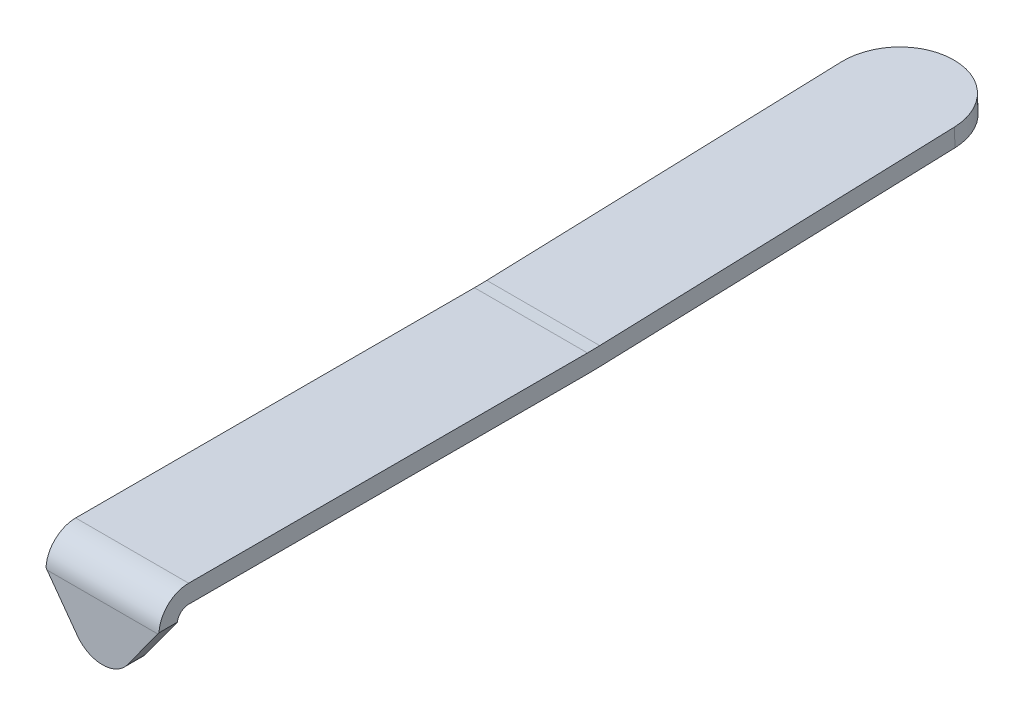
ISO-10303-21;
HEADER;
FILE_DESCRIPTION(('STEP AP214'),'2;1');
FILE_NAME('part.step','',(''),(''),'','','');
FILE_SCHEMA(('AUTOMOTIVE_DESIGN { 1 0 10303 214 1 1 1 1 }'));
ENDSEC;
DATA;
#1=APPLICATION_CONTEXT('core data for automotive mechanical design processes');
#2=APPLICATION_PROTOCOL_DEFINITION('international standard','automotive_design',2000,#1);
#3=PRODUCT_CONTEXT('',#1,'mechanical');
#4=PRODUCT('Part','Part','',(#3));
#5=PRODUCT_RELATED_PRODUCT_CATEGORY('part','',(#4));
#6=PRODUCT_DEFINITION_FORMATION('','',#4);
#7=PRODUCT_DEFINITION_CONTEXT('part definition',#1,'design');
#8=PRODUCT_DEFINITION('design','',#6,#7);
#9=PRODUCT_DEFINITION_SHAPE('','',#8);
#10=(LENGTH_UNIT() NAMED_UNIT(*) SI_UNIT(.MILLI.,.METRE.));
#11=(NAMED_UNIT(*) PLANE_ANGLE_UNIT() SI_UNIT($,.RADIAN.));
#12=(NAMED_UNIT(*) SI_UNIT($,.STERADIAN.) SOLID_ANGLE_UNIT());
#13=UNCERTAINTY_MEASURE_WITH_UNIT(LENGTH_MEASURE(1.E-05),#10,'distance_accuracy_value','');
#14=(GEOMETRIC_REPRESENTATION_CONTEXT(3) GLOBAL_UNCERTAINTY_ASSIGNED_CONTEXT((#13)) GLOBAL_UNIT_ASSIGNED_CONTEXT((#10,
#11,#12)) REPRESENTATION_CONTEXT('',''));
#15=CARTESIAN_POINT('',(0.,0.,0.));
#16=DIRECTION('',(0.,0.,1.));
#17=DIRECTION('',(1.,0.,0.));
#18=AXIS2_PLACEMENT_3D('',#15,#16,#17);
#19=CARTESIAN_POINT('',(-3.9243,1.27,0.));
#20=DIRECTION('',(0.,0.,-1.));
#21=DIRECTION('',(0.,1.,0.));
#22=AXIS2_PLACEMENT_3D('',#19,#20,#21);
#23=PLANE('',#22);
#24=DIRECTION('',(0.587785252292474,0.809016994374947,0.));
#25=VECTOR('',#24,1.);
#26=CARTESIAN_POINT('',(3.9243,-0.68477461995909,0.));
#27=LINE('',#26,#25);
#28=CARTESIAN_POINT('',(1.74666769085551,-3.68202835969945,0.));
#29=VERTEX_POINT('',#28);
#30=CARTESIAN_POINT('',(3.84512475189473,-0.793749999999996,0.));
#31=VERTEX_POINT('',#30);
#32=EDGE_CURVE('E160',#29,#31,#27,.T.);
#33=ORIENTED_EDGE('',*,*,#32,.T.);
#34=DIRECTION('',(1.,0.,0.));
#35=VECTOR('',#34,1.);
#36=CARTESIAN_POINT('',(-3.9243,-0.793749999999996,0.));
#37=LINE('',#36,#35);
#38=CARTESIAN_POINT('',(-3.84512475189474,-0.793749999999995,0.));
#39=VERTEX_POINT('',#38);
#40=EDGE_CURVE('E257',#31,#39,#37,.F.);
#41=ORIENTED_EDGE('',*,*,#40,.T.);
#42=DIRECTION('',(0.587785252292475,-0.809016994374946,0.));
#43=VECTOR('',#42,1.);
#44=CARTESIAN_POINT('',(-1.74666769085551,-3.68202835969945,0.));
#45=LINE('',#44,#43);
#46=CARTESIAN_POINT('',(-1.74666769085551,-3.68202835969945,0.));
#47=VERTEX_POINT('',#46);
#48=EDGE_CURVE('E180',#39,#47,#45,.T.);
#49=ORIENTED_EDGE('',*,*,#48,.T.);
#50=CARTESIAN_POINT('',(0.,-2.413,0.));
#51=DIRECTION('',(0.,0.,1.));
#52=DIRECTION('',(-1.,0.,0.));
#53=AXIS2_PLACEMENT_3D('',#50,#51,#52);
#54=CIRCLE('',#53,2.159);
#55=EDGE_CURVE('E185',#47,#29,#54,.T.);
#56=ORIENTED_EDGE('',*,*,#55,.T.);
#57=EDGE_LOOP('',(#33,#41,#49,#56));
#58=FACE_BOUND('',#57,.T.);
#59=ADVANCED_FACE('F35',(#58),#23,.F.);
#60=CARTESIAN_POINT('',(-3.9243,1.27,-29.765625));
#61=DIRECTION('',(0.,-1.,0.));
#62=DIRECTION('',(0.,0.,-1.));
#63=AXIS2_PLACEMENT_3D('',#60,#61,#62);
#64=PLANE('',#63);
#65=DIRECTION('',(0.,0.,-1.));
#66=VECTOR('',#65,1.);
#67=CARTESIAN_POINT('',(-3.9243,1.27,-29.765625));
#68=LINE('',#67,#66);
#69=CARTESIAN_POINT('',(-3.9243,1.27,-2.06375));
#70=VERTEX_POINT('',#69);
#71=CARTESIAN_POINT('',(-3.9243,1.27,-29.765625));
#72=VERTEX_POINT('',#71);
#73=EDGE_CURVE('E194',#70,#72,#68,.T.);
#74=ORIENTED_EDGE('',*,*,#73,.F.);
#75=DIRECTION('',(1.,0.,0.));
#76=VECTOR('',#75,1.);
#77=CARTESIAN_POINT('',(-3.9243,1.27,-2.06375));
#78=LINE('',#77,#76);
#79=CARTESIAN_POINT('',(3.9243,1.27,-2.06375));
#80=VERTEX_POINT('',#79);
#81=EDGE_CURVE('E250',#70,#80,#78,.T.);
#82=ORIENTED_EDGE('',*,*,#81,.T.);
#83=DIRECTION('',(0.,0.,-1.));
#84=VECTOR('',#83,1.);
#85=CARTESIAN_POINT('',(3.9243,1.27,-29.765625));
#86=LINE('',#85,#84);
#87=CARTESIAN_POINT('',(3.9243,1.27,-29.765625));
#88=VERTEX_POINT('',#87);
#89=EDGE_CURVE('E189',#80,#88,#86,.T.);
#90=ORIENTED_EDGE('',*,*,#89,.T.);
#91=DIRECTION('',(1.,0.,0.));
#92=VECTOR('',#91,1.);
#93=CARTESIAN_POINT('',(-3.9243,1.27,-29.765625));
#94=LINE('',#93,#92);
#95=EDGE_CURVE('E234',#72,#88,#94,.T.);
#96=ORIENTED_EDGE('',*,*,#95,.F.);
#97=EDGE_LOOP('',(#74,#82,#90,#96));
#98=FACE_BOUND('',#97,.T.);
#99=ADVANCED_FACE('F308',(#98),#64,.F.);
#100=CARTESIAN_POINT('',(-3.9243,26.67,-29.765625));
#101=DIRECTION('',(1.,0.,0.));
#102=DIRECTION('',(0.,0.,-1.));
#103=AXIS2_PLACEMENT_3D('',#100,#101,#102);
#104=CYLINDRICAL_SURFACE('',#103,25.4);
#105=CARTESIAN_POINT('',(3.9243,26.67,-29.765625));
#106=DIRECTION('',(1.,0.,0.));
#107=DIRECTION('',(0.,0.,1.));
#108=AXIS2_PLACEMENT_3D('',#105,#106,#107);
#109=CIRCLE('',#108,25.4);
#110=CARTESIAN_POINT('',(3.9243,1.2843645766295,-30.6197410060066));
#111=VERTEX_POINT('',#110);
#112=EDGE_CURVE('E210',#88,#111,#109,.T.);
#113=ORIENTED_EDGE('',*,*,#112,.T.);
#114=DIRECTION('',(1.,0.,0.));
#115=VECTOR('',#114,1.);
#116=CARTESIAN_POINT('',(-3.9243,1.2843645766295,-30.6197410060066));
#117=LINE('',#116,#115);
#118=CARTESIAN_POINT('',(-3.9243,1.2843645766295,-30.6197410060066));
#119=VERTEX_POINT('',#118);
#120=EDGE_CURVE('E231',#119,#111,#117,.T.);
#121=ORIENTED_EDGE('',*,*,#120,.F.);
#122=CARTESIAN_POINT('',(-3.9243,26.67,-29.765625));
#123=DIRECTION('',(1.,0.,0.));
#124=DIRECTION('',(0.,0.,1.));
#125=AXIS2_PLACEMENT_3D('',#122,#123,#124);
#126=CIRCLE('',#125,25.4);
#127=EDGE_CURVE('E196',#72,#119,#126,.T.);
#128=ORIENTED_EDGE('',*,*,#127,.F.);
#129=ORIENTED_EDGE('',*,*,#95,.T.);
#130=EDGE_LOOP('',(#113,#121,#128,#129));
#131=FACE_BOUND('',#130,.T.);
#132=ADVANCED_FACE('F314',(#131),#104,.F.);
#133=CARTESIAN_POINT('',(-3.9243,2.24392325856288,-59.1392941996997));
#134=DIRECTION('',(0.,-0.999434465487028,-0.0336266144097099));
#135=DIRECTION('',(0.,0.0336266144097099,-0.999434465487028));
#136=AXIS2_PLACEMENT_3D('',#133,#134,#135);
#137=PLANE('',#136);
#138=DIRECTION('',(0.,0.0336266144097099,-0.999434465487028));
#139=VECTOR('',#138,1.);
#140=CARTESIAN_POINT('',(3.9243,2.24392325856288,-59.1392941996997));
#141=LINE('',#140,#139);
#142=CARTESIAN_POINT('',(3.9243,2.11324350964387,-55.255291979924));
#143=VERTEX_POINT('',#142);
#144=EDGE_CURVE('E212',#111,#143,#141,.T.);
#145=ORIENTED_EDGE('',*,*,#144,.T.);
#146=CARTESIAN_POINT('',(0.0381000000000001,2.11324350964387,-55.255291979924));
#147=DIRECTION('',(0.,-0.999434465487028,-0.0336266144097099));
#148=DIRECTION('',(0.,0.0336266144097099,-0.999434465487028));
#149=AXIS2_PLACEMENT_3D('',#146,#147,#148);
#150=CIRCLE('',#149,3.8862);
#151=CARTESIAN_POINT('',(0.0381000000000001,2.24392325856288,-59.1392941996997));
#152=VERTEX_POINT('',#151);
#153=EDGE_CURVE('E43',#143,#152,#150,.F.);
#154=ORIENTED_EDGE('',*,*,#153,.T.);
#155=DIRECTION('',(1.,0.,0.));
#156=VECTOR('',#155,1.);
#157=CARTESIAN_POINT('',(-3.9243,2.24392325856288,-59.1392941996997));
#158=LINE('',#157,#156);
#159=CARTESIAN_POINT('',(-0.0380999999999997,2.24392325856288,-59.1392941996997));
#160=VERTEX_POINT('',#159);
#161=EDGE_CURVE('E228',#160,#152,#158,.T.);
#162=ORIENTED_EDGE('',*,*,#161,.F.);
#163=CARTESIAN_POINT('',(-0.0380999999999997,2.11324350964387,-55.255291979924));
#164=DIRECTION('',(0.,-0.999434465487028,-0.0336266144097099));
#165=DIRECTION('',(0.,0.0336266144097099,-0.999434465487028));
#166=AXIS2_PLACEMENT_3D('',#163,#164,#165);
#167=CIRCLE('',#166,3.8862);
#168=CARTESIAN_POINT('',(-3.9243,2.11324350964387,-55.255291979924));
#169=VERTEX_POINT('',#168);
#170=EDGE_CURVE('E50',#160,#169,#167,.F.);
#171=ORIENTED_EDGE('',*,*,#170,.T.);
#172=DIRECTION('',(0.,0.0336266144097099,-0.999434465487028));
#173=VECTOR('',#172,1.);
#174=CARTESIAN_POINT('',(-3.9243,2.24392325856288,-59.1392941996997));
#175=LINE('',#174,#173);
#176=EDGE_CURVE('E199',#119,#169,#175,.T.);
#177=ORIENTED_EDGE('',*,*,#176,.F.);
#178=ORIENTED_EDGE('',*,*,#120,.T.);
#179=EDGE_LOOP('',(#145,#154,#162,#171,#177,#178));
#180=FACE_BOUND('',#179,.T.);
#181=ADVANCED_FACE('F274',(#180),#137,.F.);
#182=CARTESIAN_POINT('',(-3.9243,0.974641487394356,-59.182));
#183=DIRECTION('',(0.,-0.0336266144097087,0.999434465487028));
#184=DIRECTION('',(0.,-0.999434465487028,-0.0336266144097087));
#185=AXIS2_PLACEMENT_3D('',#182,#183,#184);
#186=PLANE('',#185);
#187=ORIENTED_EDGE('',*,*,#161,.T.);
#188=DIRECTION('',(0.,-0.999434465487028,-0.0336266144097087));
#189=VECTOR('',#188,1.);
#190=CARTESIAN_POINT('',(0.0381000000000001,0.974641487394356,-59.182));
#191=LINE('',#190,#189);
#192=CARTESIAN_POINT('',(0.0381000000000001,0.974641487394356,-59.182));
#193=VERTEX_POINT('',#192);
#194=EDGE_CURVE('E265',#152,#193,#191,.T.);
#195=ORIENTED_EDGE('',*,*,#194,.T.);
#196=DIRECTION('',(1.,0.,0.));
#197=VECTOR('',#196,1.);
#198=CARTESIAN_POINT('',(-3.9243,0.974641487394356,-59.182));
#199=LINE('',#198,#197);
#200=CARTESIAN_POINT('',(-0.0380999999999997,0.974641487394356,-59.182));
#201=VERTEX_POINT('',#200);
#202=EDGE_CURVE('E225',#201,#193,#199,.T.);
#203=ORIENTED_EDGE('',*,*,#202,.F.);
#204=DIRECTION('',(0.,-0.999434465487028,-0.0336266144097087));
#205=VECTOR('',#204,1.);
#206=CARTESIAN_POINT('',(-0.0380999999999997,0.974641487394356,-59.182));
#207=LINE('',#206,#205);
#208=EDGE_CURVE('E263',#201,#160,#207,.F.);
#209=ORIENTED_EDGE('',*,*,#208,.T.);
#210=EDGE_LOOP('',(#187,#195,#203,#209));
#211=FACE_BOUND('',#210,.T.);
#212=ADVANCED_FACE('F278',(#211),#186,.F.);
#213=CARTESIAN_POINT('',(-3.9243,0.0150828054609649,-30.662446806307));
#214=DIRECTION('',(0.,0.999434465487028,0.0336266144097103));
#215=DIRECTION('',(0.,-0.0336266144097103,0.999434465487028));
#216=AXIS2_PLACEMENT_3D('',#213,#214,#215);
#217=PLANE('',#216);
#218=ORIENTED_EDGE('',*,*,#202,.T.);
#219=CARTESIAN_POINT('',(0.0381000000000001,0.84396173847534,-55.2979977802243));
#220=DIRECTION('',(0.,0.999434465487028,0.0336266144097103));
#221=DIRECTION('',(0.,-0.0336266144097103,0.999434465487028));
#222=AXIS2_PLACEMENT_3D('',#219,#220,#221);
#223=CIRCLE('',#222,3.8862);
#224=CARTESIAN_POINT('',(3.9243,0.84396173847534,-55.2979977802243));
#225=VERTEX_POINT('',#224);
#226=EDGE_CURVE('E270',#193,#225,#223,.F.);
#227=ORIENTED_EDGE('',*,*,#226,.T.);
#228=DIRECTION('',(0.,-0.0336266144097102,0.999434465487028));
#229=VECTOR('',#228,1.);
#230=CARTESIAN_POINT('',(3.9243,0.0150828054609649,-30.662446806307));
#231=LINE('',#230,#229);
#232=CARTESIAN_POINT('',(3.9243,0.0150828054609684,-30.662446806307));
#233=VERTEX_POINT('',#232);
#234=EDGE_CURVE('E214',#225,#233,#231,.T.);
#235=ORIENTED_EDGE('',*,*,#234,.T.);
#236=DIRECTION('',(1.,0.,0.));
#237=VECTOR('',#236,1.);
#238=CARTESIAN_POINT('',(-3.9243,0.0150828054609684,-30.662446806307));
#239=LINE('',#238,#237);
#240=CARTESIAN_POINT('',(-3.9243,0.0150828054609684,-30.662446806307));
#241=VERTEX_POINT('',#240);
#242=EDGE_CURVE('E222',#241,#233,#239,.T.);
#243=ORIENTED_EDGE('',*,*,#242,.F.);
#244=DIRECTION('',(0.,-0.0336266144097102,0.999434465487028));
#245=VECTOR('',#244,1.);
#246=CARTESIAN_POINT('',(-3.9243,0.0150828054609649,-30.662446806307));
#247=LINE('',#246,#245);
#248=CARTESIAN_POINT('',(-3.9243,0.84396173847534,-55.2979977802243));
#249=VERTEX_POINT('',#248);
#250=EDGE_CURVE('E201',#249,#241,#247,.T.);
#251=ORIENTED_EDGE('',*,*,#250,.F.);
#252=CARTESIAN_POINT('',(-0.0380999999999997,0.843961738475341,-55.2979977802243));
#253=DIRECTION('',(0.,0.999434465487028,0.0336266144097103));
#254=DIRECTION('',(0.,-0.0336266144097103,0.999434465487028));
#255=AXIS2_PLACEMENT_3D('',#252,#253,#254);
#256=CIRCLE('',#255,3.8862);
#257=EDGE_CURVE('E268',#249,#201,#256,.F.);
#258=ORIENTED_EDGE('',*,*,#257,.T.);
#259=EDGE_LOOP('',(#218,#227,#235,#243,#251,#258));
#260=FACE_BOUND('',#259,.T.);
#261=ADVANCED_FACE('F283',(#260),#217,.F.);
#262=CARTESIAN_POINT('',(-3.9243,26.67,-29.7656250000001));
#263=DIRECTION('',(1.,0.,0.));
#264=DIRECTION('',(0.,0.,-1.));
#265=AXIS2_PLACEMENT_3D('',#262,#263,#264);
#266=CYLINDRICAL_SURFACE('',#265,26.67);
#267=CARTESIAN_POINT('',(3.9243,26.67,-29.7656250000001));
#268=DIRECTION('',(-1.,0.,0.));
#269=DIRECTION('',(0.,0.,-1.));
#270=AXIS2_PLACEMENT_3D('',#267,#268,#269);
#271=CIRCLE('',#270,26.67);
#272=CARTESIAN_POINT('',(3.9243,0.,-29.765625));
#273=VERTEX_POINT('',#272);
#274=EDGE_CURVE('E216',#233,#273,#271,.T.);
#275=ORIENTED_EDGE('',*,*,#274,.T.);
#276=DIRECTION('',(1.,0.,0.));
#277=VECTOR('',#276,1.);
#278=CARTESIAN_POINT('',(-3.9243,0.,-29.765625));
#279=LINE('',#278,#277);
#280=CARTESIAN_POINT('',(-3.9243,0.,-29.765625));
#281=VERTEX_POINT('',#280);
#282=EDGE_CURVE('E208',#281,#273,#279,.T.);
#283=ORIENTED_EDGE('',*,*,#282,.F.);
#284=CARTESIAN_POINT('',(-3.9243,26.67,-29.7656250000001));
#285=DIRECTION('',(-1.,0.,0.));
#286=DIRECTION('',(0.,0.,-1.));
#287=AXIS2_PLACEMENT_3D('',#284,#285,#286);
#288=CIRCLE('',#287,26.67);
#289=EDGE_CURVE('E203',#241,#281,#288,.T.);
#290=ORIENTED_EDGE('',*,*,#289,.F.);
#291=ORIENTED_EDGE('',*,*,#242,.T.);
#292=EDGE_LOOP('',(#275,#283,#290,#291));
#293=FACE_BOUND('',#292,.T.);
#294=ADVANCED_FACE('F290',(#293),#266,.T.);
#295=CARTESIAN_POINT('',(-3.9243,0.,0.));
#296=DIRECTION('',(0.,1.,0.));
#297=DIRECTION('',(0.,0.,1.));
#298=AXIS2_PLACEMENT_3D('',#295,#296,#297);
#299=PLANE('',#298);
#300=DIRECTION('',(0.,0.,1.));
#301=VECTOR('',#300,1.);
#302=CARTESIAN_POINT('',(3.9243,0.,0.));
#303=LINE('',#302,#301);
#304=CARTESIAN_POINT('',(3.9243,0.,-2.06375));
#305=VERTEX_POINT('',#304);
#306=EDGE_CURVE('E197',#273,#305,#303,.T.);
#307=ORIENTED_EDGE('',*,*,#306,.T.);
#308=DIRECTION('',(-1.,0.,0.));
#309=VECTOR('',#308,1.);
#310=CARTESIAN_POINT('',(-3.9243,0.,-2.06375));
#311=LINE('',#310,#309);
#312=CARTESIAN_POINT('',(-3.9243,0.,-2.06375));
#313=VERTEX_POINT('',#312);
#314=EDGE_CURVE('E237',#305,#313,#311,.T.);
#315=ORIENTED_EDGE('',*,*,#314,.T.);
#316=DIRECTION('',(0.,0.,1.));
#317=VECTOR('',#316,1.);
#318=CARTESIAN_POINT('',(-3.9243,0.,0.));
#319=LINE('',#318,#317);
#320=EDGE_CURVE('E205',#281,#313,#319,.T.);
#321=ORIENTED_EDGE('',*,*,#320,.F.);
#322=ORIENTED_EDGE('',*,*,#282,.T.);
#323=EDGE_LOOP('',(#307,#315,#321,#322));
#324=FACE_BOUND('',#323,.T.);
#325=ADVANCED_FACE('F294',(#324),#299,.F.);
#326=CARTESIAN_POINT('',(-3.9243,26.67,-29.7656250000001));
#327=DIRECTION('',(1.,0.,0.));
#328=DIRECTION('',(0.,0.,-1.));
#329=AXIS2_PLACEMENT_3D('',#326,#327,#328);
#330=PLANE('',#329);
#331=ORIENTED_EDGE('',*,*,#176,.T.);
#332=DIRECTION('',(0.,-0.999434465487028,-0.0336266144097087));
#333=VECTOR('',#332,1.);
#334=CARTESIAN_POINT('',(-3.9243,27.4988789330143,-54.4011759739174));
#335=LINE('',#334,#333);
#336=EDGE_CURVE('E11',#169,#249,#335,.T.);
#337=ORIENTED_EDGE('',*,*,#336,.T.);
#338=ORIENTED_EDGE('',*,*,#250,.T.);
#339=ORIENTED_EDGE('',*,*,#289,.T.);
#340=ORIENTED_EDGE('',*,*,#320,.T.);
#341=CARTESIAN_POINT('',(-3.9243,-0.79375,-2.06375));
#342=DIRECTION('',(1.,0.,0.));
#343=DIRECTION('',(0.,0.,-1.));
#344=AXIS2_PLACEMENT_3D('',#341,#342,#343);
#345=CIRCLE('',#344,0.79375);
#346=CARTESIAN_POINT('',(-3.9243,-0.684774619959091,-1.27751630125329));
#347=VERTEX_POINT('',#346);
#348=EDGE_CURVE('E241',#313,#347,#345,.T.);
#349=ORIENTED_EDGE('',*,*,#348,.T.);
#350=DIRECTION('',(0.,0.,1.));
#351=VECTOR('',#350,1.);
#352=CARTESIAN_POINT('',(-3.9243,-0.684774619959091,-1.27));
#353=LINE('',#352,#351);
#354=CARTESIAN_POINT('',(-3.9243,-0.684774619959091,-0.00287920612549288));
#355=VERTEX_POINT('',#354);
#356=EDGE_CURVE('E190',#347,#355,#353,.T.);
#357=ORIENTED_EDGE('',*,*,#356,.T.);
#358=CARTESIAN_POINT('',(-3.9243,-0.793749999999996,-2.06375));
#359=DIRECTION('',(1.,0.,0.));
#360=DIRECTION('',(0.,0.,-1.));
#361=AXIS2_PLACEMENT_3D('',#358,#359,#360);
#362=CIRCLE('',#361,2.06375);
#363=EDGE_CURVE('E261',#355,#70,#362,.F.);
#364=ORIENTED_EDGE('',*,*,#363,.T.);
#365=ORIENTED_EDGE('',*,*,#73,.T.);
#366=ORIENTED_EDGE('',*,*,#127,.T.);
#367=EDGE_LOOP('',(#331,#337,#338,#339,#340,#349,#357,#364,#365,#366));
#368=FACE_BOUND('',#367,.T.);
#369=ADVANCED_FACE('F297',(#368),#330,.F.);
#370=CARTESIAN_POINT('',(3.9243,26.67,-29.7656250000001));
#371=DIRECTION('',(1.,0.,0.));
#372=DIRECTION('',(0.,0.,-1.));
#373=AXIS2_PLACEMENT_3D('',#370,#371,#372);
#374=PLANE('',#373);
#375=ORIENTED_EDGE('',*,*,#234,.F.);
#376=DIRECTION('',(0.,-0.999434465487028,-0.0336266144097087));
#377=VECTOR('',#376,1.);
#378=CARTESIAN_POINT('',(3.9243,2.11324350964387,-55.255291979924));
#379=LINE('',#378,#377);
#380=EDGE_CURVE('E58',#225,#143,#379,.F.);
#381=ORIENTED_EDGE('',*,*,#380,.T.);
#382=ORIENTED_EDGE('',*,*,#144,.F.);
#383=ORIENTED_EDGE('',*,*,#112,.F.);
#384=ORIENTED_EDGE('',*,*,#89,.F.);
#385=CARTESIAN_POINT('',(3.9243,-0.793749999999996,-2.06375));
#386=DIRECTION('',(1.,0.,0.));
#387=DIRECTION('',(0.,0.,-1.));
#388=AXIS2_PLACEMENT_3D('',#385,#386,#387);
#389=CIRCLE('',#388,2.06375);
#390=CARTESIAN_POINT('',(3.9243,-0.68477461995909,-0.00287920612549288));
#391=VERTEX_POINT('',#390);
#392=EDGE_CURVE('E253',#80,#391,#389,.T.);
#393=ORIENTED_EDGE('',*,*,#392,.T.);
#394=DIRECTION('',(0.,0.,1.));
#395=VECTOR('',#394,1.);
#396=CARTESIAN_POINT('',(3.9243,-0.68477461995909,-1.27));
#397=LINE('',#396,#395);
#398=CARTESIAN_POINT('',(3.9243,-0.68477461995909,-1.27751630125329));
#399=VERTEX_POINT('',#398);
#400=EDGE_CURVE('E165',#399,#391,#397,.T.);
#401=ORIENTED_EDGE('',*,*,#400,.F.);
#402=CARTESIAN_POINT('',(3.9243,-0.79375,-2.06375));
#403=DIRECTION('',(1.,0.,0.));
#404=DIRECTION('',(0.,0.,-1.));
#405=AXIS2_PLACEMENT_3D('',#402,#403,#404);
#406=CIRCLE('',#405,0.79375);
#407=EDGE_CURVE('E248',#399,#305,#406,.F.);
#408=ORIENTED_EDGE('',*,*,#407,.T.);
#409=ORIENTED_EDGE('',*,*,#306,.F.);
#410=ORIENTED_EDGE('',*,*,#274,.F.);
#411=EDGE_LOOP('',(#375,#381,#382,#383,#384,#393,#401,#408,#409,#410));
#412=FACE_BOUND('',#411,.T.);
#413=ADVANCED_FACE('F286',(#412),#374,.T.);
#414=CARTESIAN_POINT('',(0.,-2.413,-1.27));
#415=DIRECTION('',(0.,0.,-1.));
#416=DIRECTION('',(-1.,0.,0.));
#417=AXIS2_PLACEMENT_3D('',#414,#415,#416);
#418=PLANE('',#417);
#419=DIRECTION('',(0.587785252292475,-0.809016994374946,0.));
#420=VECTOR('',#419,1.);
#421=CARTESIAN_POINT('',(-1.74666769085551,-3.68202835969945,-1.27));
#422=LINE('',#421,#420);
#423=CARTESIAN_POINT('',(-3.84512475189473,-0.79375,-1.27));
#424=VERTEX_POINT('',#423);
#425=CARTESIAN_POINT('',(-1.74666769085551,-3.68202835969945,-1.27));
#426=VERTEX_POINT('',#425);
#427=EDGE_CURVE('E166',#424,#426,#422,.T.);
#428=ORIENTED_EDGE('',*,*,#427,.F.);
#429=DIRECTION('',(-1.,0.,0.));
#430=VECTOR('',#429,1.);
#431=CARTESIAN_POINT('',(0.,-0.79375,-1.27));
#432=LINE('',#431,#430);
#433=CARTESIAN_POINT('',(3.84512475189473,-0.79375,-1.27));
#434=VERTEX_POINT('',#433);
#435=EDGE_CURVE('E174',#424,#434,#432,.F.);
#436=ORIENTED_EDGE('',*,*,#435,.T.);
#437=DIRECTION('',(0.587785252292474,0.809016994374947,0.));
#438=VECTOR('',#437,1.);
#439=CARTESIAN_POINT('',(3.9243,-0.68477461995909,-1.27));
#440=LINE('',#439,#438);
#441=CARTESIAN_POINT('',(1.74666769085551,-3.68202835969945,-1.27));
#442=VERTEX_POINT('',#441);
#443=EDGE_CURVE('E157',#442,#434,#440,.T.);
#444=ORIENTED_EDGE('',*,*,#443,.F.);
#445=CARTESIAN_POINT('',(0.,-2.413,-1.27));
#446=DIRECTION('',(0.,0.,1.));
#447=DIRECTION('',(-1.,0.,0.));
#448=AXIS2_PLACEMENT_3D('',#445,#446,#447);
#449=CIRCLE('',#448,2.159);
#450=EDGE_CURVE('E172',#426,#442,#449,.T.);
#451=ORIENTED_EDGE('',*,*,#450,.F.);
#452=EDGE_LOOP('',(#428,#436,#444,#451));
#453=FACE_BOUND('',#452,.T.);
#454=ADVANCED_FACE('F171',(#453),#418,.T.);
#455=CARTESIAN_POINT('',(0.,-2.413,-1.27));
#456=DIRECTION('',(0.,0.,1.));
#457=DIRECTION('',(1.,0.,0.));
#458=AXIS2_PLACEMENT_3D('',#455,#456,#457);
#459=CYLINDRICAL_SURFACE('',#458,2.159);
#460=ORIENTED_EDGE('',*,*,#55,.F.);
#461=DIRECTION('',(0.,0.,1.));
#462=VECTOR('',#461,1.);
#463=CARTESIAN_POINT('',(-1.74666769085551,-3.68202835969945,-1.27));
#464=LINE('',#463,#462);
#465=EDGE_CURVE('E179',#426,#47,#464,.T.);
#466=ORIENTED_EDGE('',*,*,#465,.F.);
#467=ORIENTED_EDGE('',*,*,#450,.T.);
#468=DIRECTION('',(0.,0.,1.));
#469=VECTOR('',#468,1.);
#470=CARTESIAN_POINT('',(1.74666769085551,-3.68202835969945,-1.27));
#471=LINE('',#470,#469);
#472=EDGE_CURVE('E152',#442,#29,#471,.T.);
#473=ORIENTED_EDGE('',*,*,#472,.T.);
#474=EDGE_LOOP('',(#460,#466,#467,#473));
#475=FACE_BOUND('',#474,.T.);
#476=ADVANCED_FACE('F177',(#475),#459,.T.);
#477=CARTESIAN_POINT('',(-1.74666769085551,-3.68202835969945,-1.27));
#478=DIRECTION('',(-0.809016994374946,-0.587785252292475,0.));
#479=DIRECTION('',(0.587785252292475,-0.809016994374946,0.));
#480=AXIS2_PLACEMENT_3D('',#477,#478,#479);
#481=PLANE('',#480);
#482=ORIENTED_EDGE('',*,*,#48,.F.);
#483=CARTESIAN_POINT('',(-3.84512475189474,-0.793749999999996,-2.06375));
#484=DIRECTION('',(-0.809016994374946,-0.587785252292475,0.));
#485=DIRECTION('',(0.587785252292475,-0.809016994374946,0.));
#486=AXIS2_PLACEMENT_3D('',#483,#484,#485);
#487=ELLIPSE('',#486,2.55093528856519,2.06375);
#488=EDGE_CURVE('E259',#39,#355,#487,.T.);
#489=ORIENTED_EDGE('',*,*,#488,.T.);
#490=ORIENTED_EDGE('',*,*,#356,.F.);
#491=CARTESIAN_POINT('',(-3.84512475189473,-0.79375,-2.06375));
#492=DIRECTION('',(-0.809016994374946,-0.587785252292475,0.));
#493=DIRECTION('',(-0.587785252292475,0.809016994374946,0.));
#494=AXIS2_PLACEMENT_3D('',#491,#492,#493);
#495=ELLIPSE('',#494,0.981128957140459,0.79375);
#496=EDGE_CURVE('E244',#347,#424,#495,.F.);
#497=ORIENTED_EDGE('',*,*,#496,.T.);
#498=ORIENTED_EDGE('',*,*,#427,.T.);
#499=ORIENTED_EDGE('',*,*,#465,.T.);
#500=EDGE_LOOP('',(#482,#489,#490,#497,#498,#499));
#501=FACE_BOUND('',#500,.T.);
#502=ADVANCED_FACE('F334',(#501),#481,.T.);
#503=CARTESIAN_POINT('',(3.9243,-0.68477461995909,-1.27));
#504=DIRECTION('',(0.809016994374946,-0.587785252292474,0.));
#505=DIRECTION('',(0.587785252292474,0.809016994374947,0.));
#506=AXIS2_PLACEMENT_3D('',#503,#504,#505);
#507=PLANE('',#506);
#508=ORIENTED_EDGE('',*,*,#400,.T.);
#509=CARTESIAN_POINT('',(3.84512475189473,-0.793749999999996,-2.06375));
#510=DIRECTION('',(0.809016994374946,-0.587785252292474,0.));
#511=DIRECTION('',(0.587785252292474,0.809016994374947,0.));
#512=AXIS2_PLACEMENT_3D('',#509,#510,#511);
#513=ELLIPSE('',#512,2.55093528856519,2.06375);
#514=EDGE_CURVE('E255',#391,#31,#513,.T.);
#515=ORIENTED_EDGE('',*,*,#514,.T.);
#516=ORIENTED_EDGE('',*,*,#32,.F.);
#517=ORIENTED_EDGE('',*,*,#472,.F.);
#518=ORIENTED_EDGE('',*,*,#443,.T.);
#519=CARTESIAN_POINT('',(3.84512475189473,-0.79375,-2.06375));
#520=DIRECTION('',(0.809016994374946,-0.587785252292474,0.));
#521=DIRECTION('',(-0.587785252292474,-0.809016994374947,0.));
#522=AXIS2_PLACEMENT_3D('',#519,#520,#521);
#523=ELLIPSE('',#522,0.981128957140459,0.79375);
#524=EDGE_CURVE('E246',#434,#399,#523,.F.);
#525=ORIENTED_EDGE('',*,*,#524,.T.);
#526=EDGE_LOOP('',(#508,#515,#516,#517,#518,#525));
#527=FACE_BOUND('',#526,.T.);
#528=ADVANCED_FACE('F155',(#527),#507,.T.);
#529=CARTESIAN_POINT('',(-3.9243,-0.79375,-2.06375));
#530=DIRECTION('',(-1.,0.,0.));
#531=DIRECTION('',(0.,0.,1.));
#532=AXIS2_PLACEMENT_3D('',#529,#530,#531);
#533=CYLINDRICAL_SURFACE('',#532,0.79375);
#534=ORIENTED_EDGE('',*,*,#524,.F.);
#535=ORIENTED_EDGE('',*,*,#435,.F.);
#536=ORIENTED_EDGE('',*,*,#496,.F.);
#537=ORIENTED_EDGE('',*,*,#348,.F.);
#538=ORIENTED_EDGE('',*,*,#314,.F.);
#539=ORIENTED_EDGE('',*,*,#407,.F.);
#540=EDGE_LOOP('',(#534,#535,#536,#537,#538,#539));
#541=FACE_BOUND('',#540,.T.);
#542=ADVANCED_FACE('F319',(#541),#533,.F.);
#543=CARTESIAN_POINT('',(-3.9243,-0.793749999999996,-2.06375));
#544=DIRECTION('',(1.,0.,0.));
#545=DIRECTION('',(0.,0.,-1.));
#546=AXIS2_PLACEMENT_3D('',#543,#544,#545);
#547=CYLINDRICAL_SURFACE('',#546,2.06375);
#548=ORIENTED_EDGE('',*,*,#488,.F.);
#549=ORIENTED_EDGE('',*,*,#40,.F.);
#550=ORIENTED_EDGE('',*,*,#514,.F.);
#551=ORIENTED_EDGE('',*,*,#392,.F.);
#552=ORIENTED_EDGE('',*,*,#81,.F.);
#553=ORIENTED_EDGE('',*,*,#363,.F.);
#554=EDGE_LOOP('',(#548,#549,#550,#551,#552,#553));
#555=FACE_BOUND('',#554,.T.);
#556=ADVANCED_FACE('F306',(#555),#547,.T.);
#557=CARTESIAN_POINT('',(0.0381000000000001,0.843961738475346,-55.2979977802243));
#558=DIRECTION('',(0.,0.999434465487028,0.0336266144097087));
#559=DIRECTION('',(0.,-0.0336266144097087,0.999434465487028));
#560=AXIS2_PLACEMENT_3D('',#557,#558,#559);
#561=CYLINDRICAL_SURFACE('',#560,3.8862);
#562=ORIENTED_EDGE('',*,*,#153,.F.);
#563=ORIENTED_EDGE('',*,*,#380,.F.);
#564=ORIENTED_EDGE('',*,*,#226,.F.);
#565=ORIENTED_EDGE('',*,*,#194,.F.);
#566=EDGE_LOOP('',(#562,#563,#564,#565));
#567=FACE_BOUND('',#566,.T.);
#568=ADVANCED_FACE('F281',(#567),#561,.T.);
#569=CARTESIAN_POINT('',(-0.0380999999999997,27.4988789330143,-54.4011759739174));
#570=DIRECTION('',(0.,-0.999434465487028,-0.0336266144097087));
#571=DIRECTION('',(0.,0.0336266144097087,-0.999434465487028));
#572=AXIS2_PLACEMENT_3D('',#569,#570,#571);
#573=CYLINDRICAL_SURFACE('',#572,3.8862);
#574=ORIENTED_EDGE('',*,*,#170,.F.);
#575=ORIENTED_EDGE('',*,*,#208,.F.);
#576=ORIENTED_EDGE('',*,*,#257,.F.);
#577=ORIENTED_EDGE('',*,*,#336,.F.);
#578=EDGE_LOOP('',(#574,#575,#576,#577));
#579=FACE_BOUND('',#578,.T.);
#580=ADVANCED_FACE('F37',(#579),#573,.T.);
#581=CLOSED_SHELL('',(#59,#99,#132,#181,#212,#261,#294,#325,#369,#413,#454,#476,#502,#528,#542,
#556,#568,#580));
#582=MANIFOLD_SOLID_BREP('B2',#581);
#583=ADVANCED_BREP_SHAPE_REPRESENTATION('',(#18,#582),#14);
#584=SHAPE_DEFINITION_REPRESENTATION(#9,#583);
ENDSEC;
END-ISO-10303-21;
